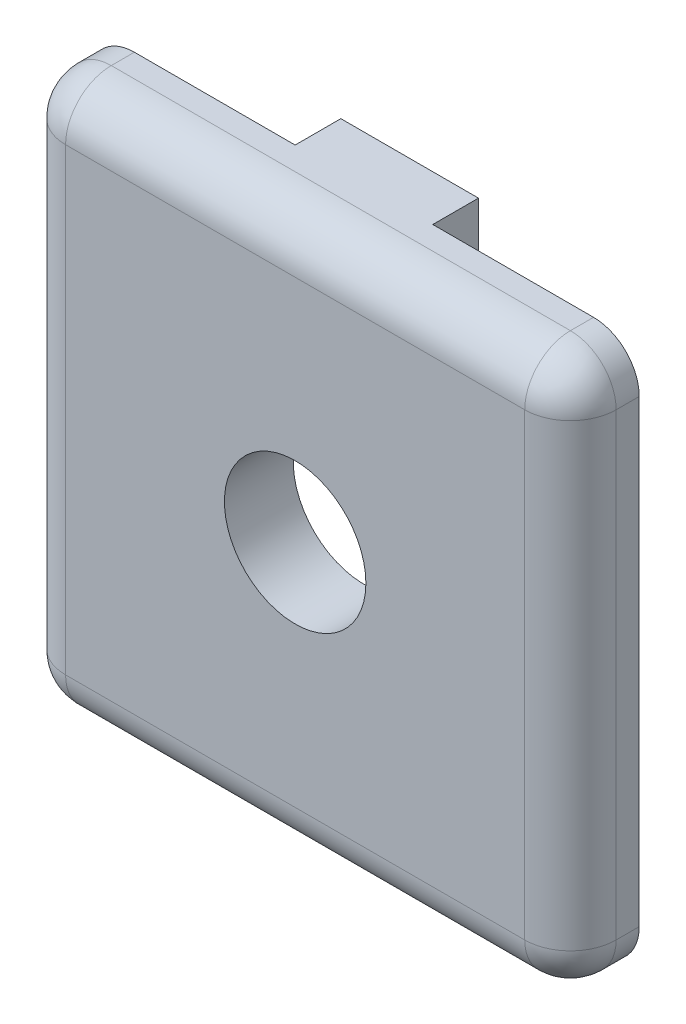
from build123d import *

# Parameters (mm, degrees)
SKETCH1_W           = 25.4
SKETCH1_H           = 25.4
BOSS_EXTRUDE1_DEPTH = 3.175
FILLET1_R           = 2.1082
CUT_EXTRUDE1_REACH  = 20.239
SKETCH2_R           = 3.2639
SKETCH3_W           = 6.35
SKETCH3_H           = 2.1082
BOSS_EXTRUDE2_DEPTH = 2.1082


with BuildPart() as part:
    # Sketch1 → Boss-Extrude1 (new body)
    with BuildSketch(Plane.XY):
        Rectangle(SKETCH1_W, SKETCH1_H)
    extrude(amount=BOSS_EXTRUDE1_DEPTH)

    # Fillet1
    fillet1_edges = [part.edges().sort_by_distance(p)[0] for p in [
        (12.7, 0, 3.175),
        (0, 12.7, 3.175),
        (-12.7, 0, 3.175),
        (0, -12.7, 3.175),
        (-12.7, 12.7, 1.5875),
        (12.7, 12.7, 1.5875),
        (12.7, -12.7, 1.5875),
        (-12.7, -12.7, 1.5875),
    ]]
    fillet(fillet1_edges, radius=FILLET1_R)

    # Sketch2 → Cut-Extrude1 (cut, up to next)
    with BuildSketch(Plane.XY.offset(3.175), mode=Mode.PRIVATE) as cut_extrude1_sk1:
        Circle(SKETCH2_R)
    cut_extrude1_tool1 = extrude(cut_extrude1_sk1.sketch, amount=-CUT_EXTRUDE1_REACH, mode=Mode.PRIVATE) & part.part
    add(cut_extrude1_tool1.solids().sort_by_distance((0, 0, 3.175))[0], mode=Mode.SUBTRACT)

    # Sketch3 → Boss-Extrude2 (add)
    with BuildSketch(Plane(origin=(0, 0, 0), x_dir=(-1, 0, 0), z_dir=(0, 0, -1))):
        with Locations((0, 11.6459)):
            Rectangle(SKETCH3_W, SKETCH3_H)
    extrude(amount=BOSS_EXTRUDE2_DEPTH)


solid = part.part
